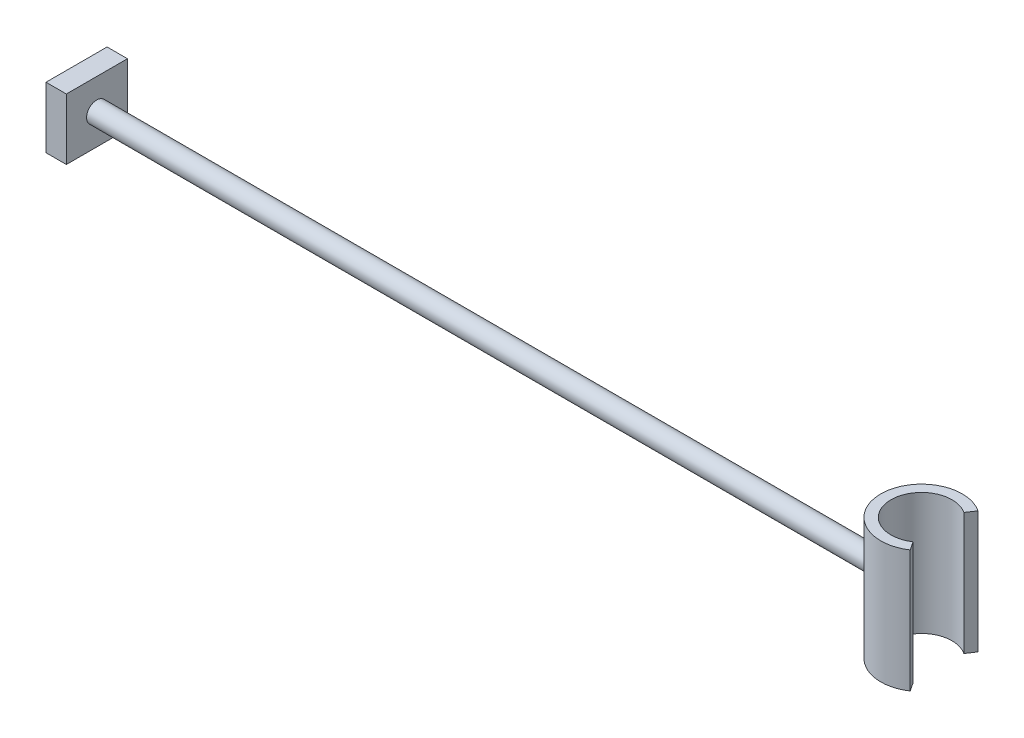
from build123d import *

# Parameters (mm, degrees)
ESQUISSE1_W             = 200
ESQUISSE1_H             = 2.5
BOSS_EXTRU_5_DEPTH      = 15
BOSS_EXTRU_5_DEPTH_BACK = 15
ESQUISSE5_W             = 15
ESQUISSE5_H             = 15
BOSS_EXTRU_6_DEPTH      = 5


with BuildPart() as part:
    # Esquisse1 → Base-R_volution (revolve)
    with BuildSketch(Plane.XY, mode=Mode.PRIVATE) as base_r_volution_sk:
        with Locations((100, 1.25)):
            Rectangle(ESQUISSE1_W, ESQUISSE1_H)
    revolve(base_r_volution_sk.sketch.rotate(Axis((-150, 0, 0), (1, 0, 0)), 90), axis=Axis((-150, 0, 0), (1, 0, 0)))

    # Esquisse4 → Boss.-Extru.5 (add, two sides: drawn at the far end of the back side and taken through both)
    with BuildSketch(Plane(origin=(0, 0, 0), x_dir=(1, 0, 0), z_dir=(0, 1, 0)).offset(-BOSS_EXTRU_5_DEPTH_BACK)):
        with BuildLine():
            Line((211.660251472, 6.240377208), (213.047001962, 8.320502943))
            ThreePointArc((213.047001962, 8.320502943), (197.5, 0), (213.047001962, -8.320502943))
            Line((213.047001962, -8.320502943), (211.660251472, -6.240377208))
            ThreePointArc((211.660251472, -6.240377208), (200, 0), (211.660251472, 6.240377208))
        make_face()
    extrude(amount=BOSS_EXTRU_5_DEPTH + BOSS_EXTRU_5_DEPTH_BACK)

    # Esquisse5 → Boss.-Extru.6 (add)
    with BuildSketch(Plane.ZY):
        with Locations((-0.04, 0)):
            Rectangle(ESQUISSE5_W, ESQUISSE5_H)
    extrude(amount=-BOSS_EXTRU_6_DEPTH)


solid = part.part
